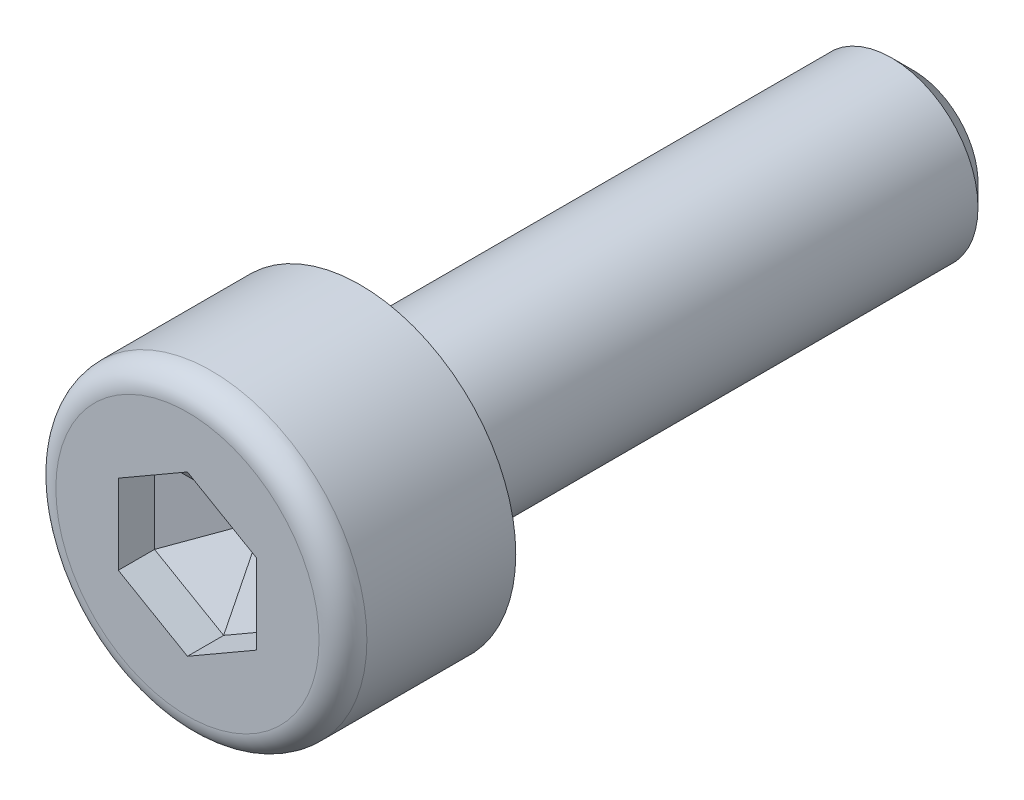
ISO-10303-21;
HEADER;
FILE_DESCRIPTION(('STEP AP214'),'2;1');
FILE_NAME('part.step','',(''),(''),'','','');
FILE_SCHEMA(('AUTOMOTIVE_DESIGN { 1 0 10303 214 1 1 1 1 }'));
ENDSEC;
DATA;
#1=APPLICATION_CONTEXT('core data for automotive mechanical design processes');
#2=APPLICATION_PROTOCOL_DEFINITION('international standard','automotive_design',2000,#1);
#3=PRODUCT_CONTEXT('',#1,'mechanical');
#4=PRODUCT('Part','Part','',(#3));
#5=PRODUCT_RELATED_PRODUCT_CATEGORY('part','',(#4));
#6=PRODUCT_DEFINITION_FORMATION('','',#4);
#7=PRODUCT_DEFINITION_CONTEXT('part definition',#1,'design');
#8=PRODUCT_DEFINITION('design','',#6,#7);
#9=PRODUCT_DEFINITION_SHAPE('','',#8);
#10=(LENGTH_UNIT() NAMED_UNIT(*) SI_UNIT(.MILLI.,.METRE.));
#11=(NAMED_UNIT(*) PLANE_ANGLE_UNIT() SI_UNIT($,.RADIAN.));
#12=(NAMED_UNIT(*) SI_UNIT($,.STERADIAN.) SOLID_ANGLE_UNIT());
#13=UNCERTAINTY_MEASURE_WITH_UNIT(LENGTH_MEASURE(1.E-05),#10,'distance_accuracy_value','');
#14=(GEOMETRIC_REPRESENTATION_CONTEXT(3) GLOBAL_UNCERTAINTY_ASSIGNED_CONTEXT((#13)) GLOBAL_UNIT_ASSIGNED_CONTEXT((#10,
#11,#12)) REPRESENTATION_CONTEXT('',''));
#15=CARTESIAN_POINT('',(0.,0.,0.));
#16=DIRECTION('',(0.,0.,1.));
#17=DIRECTION('',(1.,0.,0.));
#18=AXIS2_PLACEMENT_3D('',#15,#16,#17);
#19=CARTESIAN_POINT('',(0.,0.,0.));
#20=DIRECTION('',(0.,0.,1.));
#21=DIRECTION('',(1.,0.,0.));
#22=AXIS2_PLACEMENT_3D('',#19,#20,#21);
#23=PLANE('',#22);
#24=CARTESIAN_POINT('',(0.,0.,0.));
#25=DIRECTION('',(0.,0.,1.));
#26=DIRECTION('',(1.,0.,0.));
#27=AXIS2_PLACEMENT_3D('',#24,#25,#26);
#28=CIRCLE('',#27,1.35);
#29=CARTESIAN_POINT('',(1.35,0.,0.));
#30=VERTEX_POINT('',#29);
#31=EDGE_CURVE('E11',#30,#30,#28,.T.);
#32=ORIENTED_EDGE('',*,*,#31,.T.);
#33=EDGE_LOOP('',(#32));
#34=FACE_BOUND('',#33,.T.);
#35=CARTESIAN_POINT('',(0.,0.,0.));
#36=DIRECTION('',(0.,0.,1.));
#37=DIRECTION('',(1.,0.,0.));
#38=AXIS2_PLACEMENT_3D('',#35,#36,#37);
#39=CIRCLE('',#38,2.25);
#40=CARTESIAN_POINT('',(2.25,0.,0.));
#41=VERTEX_POINT('',#40);
#42=EDGE_CURVE('E171',#41,#41,#39,.T.);
#43=ORIENTED_EDGE('',*,*,#42,.F.);
#44=EDGE_LOOP('',(#43));
#45=FACE_BOUND('',#44,.T.);
#46=ADVANCED_FACE('F53',(#34,#45),#23,.F.);
#47=CARTESIAN_POINT('',(0.,0.,2.5));
#48=DIRECTION('',(0.,0.,-1.));
#49=DIRECTION('',(-1.,0.,0.));
#50=AXIS2_PLACEMENT_3D('',#47,#48,#49);
#51=CYLINDRICAL_SURFACE('',#50,2.25);
#52=CARTESIAN_POINT('',(0.,0.,2.15384615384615));
#53=DIRECTION('',(0.,0.,1.));
#54=DIRECTION('',(1.,0.,0.));
#55=AXIS2_PLACEMENT_3D('',#52,#53,#54);
#56=CIRCLE('',#55,2.25);
#57=CARTESIAN_POINT('',(2.25,0.,2.15384615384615));
#58=VERTEX_POINT('',#57);
#59=EDGE_CURVE('E197',#58,#58,#56,.F.);
#60=ORIENTED_EDGE('',*,*,#59,.T.);
#61=EDGE_LOOP('',(#60));
#62=FACE_BOUND('',#61,.T.);
#63=ORIENTED_EDGE('',*,*,#42,.T.);
#64=EDGE_LOOP('',(#63));
#65=FACE_BOUND('',#64,.T.);
#66=ADVANCED_FACE('F276',(#62,#65),#51,.T.);
#67=CARTESIAN_POINT('',(0.,0.,2.5));
#68=DIRECTION('',(0.,0.,1.));
#69=DIRECTION('',(1.,0.,0.));
#70=AXIS2_PLACEMENT_3D('',#67,#68,#69);
#71=PLANE('',#70);
#72=CARTESIAN_POINT('',(0.,0.,2.5));
#73=DIRECTION('',(0.,0.,1.));
#74=DIRECTION('',(1.,0.,0.));
#75=AXIS2_PLACEMENT_3D('',#72,#73,#74);
#76=CIRCLE('',#75,1.90384615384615);
#77=CARTESIAN_POINT('',(1.90384615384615,0.,2.5));
#78=VERTEX_POINT('',#77);
#79=EDGE_CURVE('E193',#78,#78,#76,.T.);
#80=ORIENTED_EDGE('',*,*,#79,.T.);
#81=EDGE_LOOP('',(#80));
#82=FACE_BOUND('',#81,.T.);
#83=DIRECTION('',(0.,1.,0.));
#84=VECTOR('',#83,1.);
#85=CARTESIAN_POINT('',(1.,-0.577350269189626,2.5));
#86=LINE('',#85,#84);
#87=CARTESIAN_POINT('',(1.,-0.577350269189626,2.5));
#88=VERTEX_POINT('',#87);
#89=CARTESIAN_POINT('',(1.,0.577350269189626,2.5));
#90=VERTEX_POINT('',#89);
#91=EDGE_CURVE('E148',#88,#90,#86,.T.);
#92=ORIENTED_EDGE('',*,*,#91,.F.);
#93=DIRECTION('',(0.866025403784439,0.5,0.));
#94=VECTOR('',#93,1.);
#95=CARTESIAN_POINT('',(0.,-1.15470053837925,2.5));
#96=LINE('',#95,#94);
#97=CARTESIAN_POINT('',(0.,-1.15470053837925,2.5));
#98=VERTEX_POINT('',#97);
#99=EDGE_CURVE('E164',#98,#88,#96,.T.);
#100=ORIENTED_EDGE('',*,*,#99,.F.);
#101=DIRECTION('',(0.866025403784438,-0.5,0.));
#102=VECTOR('',#101,1.);
#103=CARTESIAN_POINT('',(-1.,-0.577350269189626,2.5));
#104=LINE('',#103,#102);
#105=CARTESIAN_POINT('',(-1.,-0.577350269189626,2.5));
#106=VERTEX_POINT('',#105);
#107=EDGE_CURVE('E157',#106,#98,#104,.T.);
#108=ORIENTED_EDGE('',*,*,#107,.F.);
#109=DIRECTION('',(0.,-1.,0.));
#110=VECTOR('',#109,1.);
#111=CARTESIAN_POINT('',(-1.,0.577350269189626,2.5));
#112=LINE('',#111,#110);
#113=CARTESIAN_POINT('',(-1.,0.577350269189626,2.5));
#114=VERTEX_POINT('',#113);
#115=EDGE_CURVE('E153',#114,#106,#112,.T.);
#116=ORIENTED_EDGE('',*,*,#115,.F.);
#117=DIRECTION('',(-0.866025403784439,-0.5,0.));
#118=VECTOR('',#117,1.);
#119=CARTESIAN_POINT('',(0.,1.15470053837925,2.5));
#120=LINE('',#119,#118);
#121=CARTESIAN_POINT('',(0.,1.15470053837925,2.5));
#122=VERTEX_POINT('',#121);
#123=EDGE_CURVE('E131',#122,#114,#120,.T.);
#124=ORIENTED_EDGE('',*,*,#123,.F.);
#125=DIRECTION('',(-0.866025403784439,0.5,0.));
#126=VECTOR('',#125,1.);
#127=CARTESIAN_POINT('',(1.,0.577350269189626,2.5));
#128=LINE('',#127,#126);
#129=EDGE_CURVE('E142',#90,#122,#128,.T.);
#130=ORIENTED_EDGE('',*,*,#129,.F.);
#131=EDGE_LOOP('',(#92,#100,#108,#116,#124,#130));
#132=FACE_BOUND('',#131,.T.);
#133=ADVANCED_FACE('F150',(#82,#132),#71,.T.);
#134=CARTESIAN_POINT('',(1.,-0.577350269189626,1.4));
#135=DIRECTION('',(1.,0.,0.));
#136=DIRECTION('',(0.,0.,-1.));
#137=AXIS2_PLACEMENT_3D('',#134,#135,#136);
#138=PLANE('',#137);
#139=DIRECTION('',(0.,0.,1.));
#140=VECTOR('',#139,1.);
#141=CARTESIAN_POINT('',(1.,0.577350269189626,1.4));
#142=LINE('',#141,#140);
#143=CARTESIAN_POINT('',(1.,0.577350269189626,1.97636887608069));
#144=VERTEX_POINT('',#143);
#145=EDGE_CURVE('E139',#144,#90,#142,.T.);
#146=ORIENTED_EDGE('',*,*,#145,.F.);
#147=DIRECTION('',(0.,-1.,0.));
#148=VECTOR('',#147,1.);
#149=CARTESIAN_POINT('',(1.,-0.577350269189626,1.97636887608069));
#150=LINE('',#149,#148);
#151=CARTESIAN_POINT('',(1.,-0.577350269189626,1.97636887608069));
#152=VERTEX_POINT('',#151);
#153=EDGE_CURVE('E77',#144,#152,#150,.T.);
#154=ORIENTED_EDGE('',*,*,#153,.T.);
#155=DIRECTION('',(0.,0.,1.));
#156=VECTOR('',#155,1.);
#157=CARTESIAN_POINT('',(1.,-0.577350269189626,1.4));
#158=LINE('',#157,#156);
#159=EDGE_CURVE('E168',#152,#88,#158,.T.);
#160=ORIENTED_EDGE('',*,*,#159,.T.);
#161=ORIENTED_EDGE('',*,*,#91,.T.);
#162=EDGE_LOOP('',(#146,#154,#160,#161));
#163=FACE_BOUND('',#162,.T.);
#164=ADVANCED_FACE('F336',(#163),#138,.F.);
#165=CARTESIAN_POINT('',(0.,-1.15470053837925,1.4));
#166=DIRECTION('',(0.5,-0.866025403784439,0.));
#167=DIRECTION('',(0.866025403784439,0.5,0.));
#168=AXIS2_PLACEMENT_3D('',#165,#166,#167);
#169=PLANE('',#168);
#170=ORIENTED_EDGE('',*,*,#159,.F.);
#171=DIRECTION('',(-0.866025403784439,-0.5,0.));
#172=VECTOR('',#171,1.);
#173=CARTESIAN_POINT('',(0.,-1.15470053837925,1.97636887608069));
#174=LINE('',#173,#172);
#175=CARTESIAN_POINT('',(0.,-1.15470053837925,1.97636887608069));
#176=VERTEX_POINT('',#175);
#177=EDGE_CURVE('E69',#152,#176,#174,.T.);
#178=ORIENTED_EDGE('',*,*,#177,.T.);
#179=DIRECTION('',(0.,0.,1.));
#180=VECTOR('',#179,1.);
#181=CARTESIAN_POINT('',(0.,-1.15470053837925,1.4));
#182=LINE('',#181,#180);
#183=EDGE_CURVE('E172',#176,#98,#182,.T.);
#184=ORIENTED_EDGE('',*,*,#183,.T.);
#185=ORIENTED_EDGE('',*,*,#99,.T.);
#186=EDGE_LOOP('',(#170,#178,#184,#185));
#187=FACE_BOUND('',#186,.T.);
#188=ADVANCED_FACE('F339',(#187),#169,.F.);
#189=CARTESIAN_POINT('',(-1.,-0.577350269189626,1.4));
#190=DIRECTION('',(-0.5,-0.866025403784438,0.));
#191=DIRECTION('',(0.866025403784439,-0.5,0.));
#192=AXIS2_PLACEMENT_3D('',#189,#190,#191);
#193=PLANE('',#192);
#194=ORIENTED_EDGE('',*,*,#183,.F.);
#195=DIRECTION('',(-0.866025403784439,0.5,0.));
#196=VECTOR('',#195,1.);
#197=CARTESIAN_POINT('',(-1.,-0.577350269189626,1.97636887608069));
#198=LINE('',#197,#196);
#199=CARTESIAN_POINT('',(-1.,-0.577350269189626,1.97636887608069));
#200=VERTEX_POINT('',#199);
#201=EDGE_CURVE('E231',#176,#200,#198,.T.);
#202=ORIENTED_EDGE('',*,*,#201,.T.);
#203=DIRECTION('',(0.,0.,1.));
#204=VECTOR('',#203,1.);
#205=CARTESIAN_POINT('',(-1.,-0.577350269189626,1.4));
#206=LINE('',#205,#204);
#207=EDGE_CURVE('E175',#200,#106,#206,.T.);
#208=ORIENTED_EDGE('',*,*,#207,.T.);
#209=ORIENTED_EDGE('',*,*,#107,.T.);
#210=EDGE_LOOP('',(#194,#202,#208,#209));
#211=FACE_BOUND('',#210,.T.);
#212=ADVANCED_FACE('F327',(#211),#193,.F.);
#213=CARTESIAN_POINT('',(-1.,0.577350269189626,1.4));
#214=DIRECTION('',(-1.,0.,0.));
#215=DIRECTION('',(0.,0.,1.));
#216=AXIS2_PLACEMENT_3D('',#213,#214,#215);
#217=PLANE('',#216);
#218=ORIENTED_EDGE('',*,*,#207,.F.);
#219=DIRECTION('',(0.,1.,0.));
#220=VECTOR('',#219,1.);
#221=CARTESIAN_POINT('',(-1.,0.577350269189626,1.97636887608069));
#222=LINE('',#221,#220);
#223=CARTESIAN_POINT('',(-1.,0.577350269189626,1.97636887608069));
#224=VERTEX_POINT('',#223);
#225=EDGE_CURVE('E220',#200,#224,#222,.T.);
#226=ORIENTED_EDGE('',*,*,#225,.T.);
#227=DIRECTION('',(0.,0.,1.));
#228=VECTOR('',#227,1.);
#229=CARTESIAN_POINT('',(-1.,0.577350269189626,1.4));
#230=LINE('',#229,#228);
#231=EDGE_CURVE('E138',#224,#114,#230,.T.);
#232=ORIENTED_EDGE('',*,*,#231,.T.);
#233=ORIENTED_EDGE('',*,*,#115,.T.);
#234=EDGE_LOOP('',(#218,#226,#232,#233));
#235=FACE_BOUND('',#234,.T.);
#236=ADVANCED_FACE('F330',(#235),#217,.F.);
#237=CARTESIAN_POINT('',(0.,1.15470053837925,1.4));
#238=DIRECTION('',(-0.5,0.866025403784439,0.));
#239=DIRECTION('',(-0.866025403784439,-0.5,0.));
#240=AXIS2_PLACEMENT_3D('',#237,#238,#239);
#241=PLANE('',#240);
#242=ORIENTED_EDGE('',*,*,#231,.F.);
#243=DIRECTION('',(0.866025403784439,0.5,0.));
#244=VECTOR('',#243,1.);
#245=CARTESIAN_POINT('',(0.,1.15470053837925,1.97636887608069));
#246=LINE('',#245,#244);
#247=CARTESIAN_POINT('',(0.,1.15470053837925,1.97636887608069));
#248=VERTEX_POINT('',#247);
#249=EDGE_CURVE('E134',#224,#248,#246,.T.);
#250=ORIENTED_EDGE('',*,*,#249,.T.);
#251=DIRECTION('',(0.,0.,1.));
#252=VECTOR('',#251,1.);
#253=CARTESIAN_POINT('',(0.,1.15470053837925,1.4));
#254=LINE('',#253,#252);
#255=EDGE_CURVE('E126',#248,#122,#254,.T.);
#256=ORIENTED_EDGE('',*,*,#255,.T.);
#257=ORIENTED_EDGE('',*,*,#123,.T.);
#258=EDGE_LOOP('',(#242,#250,#256,#257));
#259=FACE_BOUND('',#258,.T.);
#260=ADVANCED_FACE('F129',(#259),#241,.F.);
#261=CARTESIAN_POINT('',(1.,0.577350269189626,1.4));
#262=DIRECTION('',(0.5,0.866025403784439,0.));
#263=DIRECTION('',(-0.866025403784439,0.5,0.));
#264=AXIS2_PLACEMENT_3D('',#261,#262,#263);
#265=PLANE('',#264);
#266=ORIENTED_EDGE('',*,*,#255,.F.);
#267=DIRECTION('',(0.866025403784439,-0.5,0.));
#268=VECTOR('',#267,1.);
#269=CARTESIAN_POINT('',(1.,0.577350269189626,1.97636887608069));
#270=LINE('',#269,#268);
#271=EDGE_CURVE('E226',#248,#144,#270,.T.);
#272=ORIENTED_EDGE('',*,*,#271,.T.);
#273=ORIENTED_EDGE('',*,*,#145,.T.);
#274=ORIENTED_EDGE('',*,*,#129,.T.);
#275=EDGE_LOOP('',(#266,#272,#273,#274));
#276=FACE_BOUND('',#275,.T.);
#277=ADVANCED_FACE('F143',(#276),#265,.F.);
#278=CARTESIAN_POINT('',(0.,0.,1.4));
#279=DIRECTION('',(0.,0.,1.));
#280=DIRECTION('',(1.,0.,0.));
#281=AXIS2_PLACEMENT_3D('',#278,#279,#280);
#282=PLANE('',#281);
#283=DIRECTION('',(-0.866025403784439,-0.5,0.));
#284=VECTOR('',#283,1.);
#285=CARTESIAN_POINT('',(-0.000849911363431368,0.00147208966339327,1.4));
#286=LINE('',#285,#284);
#287=CARTESIAN_POINT('',(0.,0.00196278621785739,1.4));
#288=VERTEX_POINT('',#287);
#289=CARTESIAN_POINT('',(-0.0016998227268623,0.000981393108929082,1.4));
#290=VERTEX_POINT('',#289);
#291=EDGE_CURVE('E213',#288,#290,#286,.T.);
#292=ORIENTED_EDGE('',*,*,#291,.T.);
#293=DIRECTION('',(0.,-1.,0.));
#294=VECTOR('',#293,1.);
#295=CARTESIAN_POINT('',(-0.0016998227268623,0.,1.4));
#296=LINE('',#295,#294);
#297=CARTESIAN_POINT('',(-0.0016998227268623,-0.000981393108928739,1.4));
#298=VERTEX_POINT('',#297);
#299=EDGE_CURVE('E216',#290,#298,#296,.T.);
#300=ORIENTED_EDGE('',*,*,#299,.T.);
#301=DIRECTION('',(0.866025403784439,-0.5,0.));
#302=VECTOR('',#301,1.);
#303=CARTESIAN_POINT('',(-0.000849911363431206,-0.00147208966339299,1.4));
#304=LINE('',#303,#302);
#305=CARTESIAN_POINT('',(0.,-0.00196278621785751,1.4));
#306=VERTEX_POINT('',#305);
#307=EDGE_CURVE('E204',#298,#306,#304,.T.);
#308=ORIENTED_EDGE('',*,*,#307,.T.);
#309=DIRECTION('',(0.866025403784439,0.5,0.));
#310=VECTOR('',#309,1.);
#311=CARTESIAN_POINT('',(0.000849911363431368,-0.00147208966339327,1.4));
#312=LINE('',#311,#310);
#313=CARTESIAN_POINT('',(0.0016998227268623,-0.000981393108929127,1.4));
#314=VERTEX_POINT('',#313);
#315=EDGE_CURVE('E201',#306,#314,#312,.T.);
#316=ORIENTED_EDGE('',*,*,#315,.T.);
#317=DIRECTION('',(0.,1.,0.));
#318=VECTOR('',#317,1.);
#319=CARTESIAN_POINT('',(0.0016998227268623,0.,1.4));
#320=LINE('',#319,#318);
#321=CARTESIAN_POINT('',(0.0016998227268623,0.000981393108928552,1.4));
#322=VERTEX_POINT('',#321);
#323=EDGE_CURVE('E207',#314,#322,#320,.T.);
#324=ORIENTED_EDGE('',*,*,#323,.T.);
#325=DIRECTION('',(-0.866025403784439,0.5,0.));
#326=VECTOR('',#325,1.);
#327=CARTESIAN_POINT('',(0.000849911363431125,0.00147208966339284,1.4));
#328=LINE('',#327,#326);
#329=EDGE_CURVE('E210',#322,#288,#328,.T.);
#330=ORIENTED_EDGE('',*,*,#329,.T.);
#331=EDGE_LOOP('',(#292,#300,#308,#316,#324,#330));
#332=FACE_BOUND('',#331,.T.);
#333=ADVANCED_FACE('F348',(#332),#282,.T.);
#334=CARTESIAN_POINT('',(0.,0.,-8.));
#335=DIRECTION('',(0.,0.,1.));
#336=DIRECTION('',(1.,0.,0.));
#337=AXIS2_PLACEMENT_3D('',#334,#335,#336);
#338=CYLINDRICAL_SURFACE('',#337,1.25);
#339=CARTESIAN_POINT('',(0.,0.,-0.0999999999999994));
#340=DIRECTION('',(0.,0.,1.));
#341=DIRECTION('',(1.,0.,0.));
#342=AXIS2_PLACEMENT_3D('',#339,#340,#341);
#343=CIRCLE('',#342,1.25);
#344=CARTESIAN_POINT('',(1.25,0.,-0.0999999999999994));
#345=VERTEX_POINT('',#344);
#346=EDGE_CURVE('E62',#345,#345,#343,.F.);
#347=ORIENTED_EDGE('',*,*,#346,.T.);
#348=EDGE_LOOP('',(#347));
#349=FACE_BOUND('',#348,.T.);
#350=CARTESIAN_POINT('',(0.,0.,-7.6875));
#351=DIRECTION('',(0.,0.,-1.));
#352=DIRECTION('',(-1.,0.,0.));
#353=AXIS2_PLACEMENT_3D('',#350,#351,#352);
#354=CIRCLE('',#353,1.25);
#355=CARTESIAN_POINT('',(-1.25,0.,-7.6875));
#356=VERTEX_POINT('',#355);
#357=EDGE_CURVE('E189',#356,#356,#354,.F.);
#358=ORIENTED_EDGE('',*,*,#357,.T.);
#359=EDGE_LOOP('',(#358));
#360=FACE_BOUND('',#359,.T.);
#361=ADVANCED_FACE('F261',(#349,#360),#338,.T.);
#362=CARTESIAN_POINT('',(0.,0.,-8.));
#363=DIRECTION('',(0.,0.,-1.));
#364=DIRECTION('',(-1.,0.,0.));
#365=AXIS2_PLACEMENT_3D('',#362,#363,#364);
#366=PLANE('',#365);
#367=CARTESIAN_POINT('',(0.,0.,-8.));
#368=DIRECTION('',(0.,0.,-1.));
#369=DIRECTION('',(-1.,0.,0.));
#370=AXIS2_PLACEMENT_3D('',#367,#368,#369);
#371=CIRCLE('',#370,0.937500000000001);
#372=CARTESIAN_POINT('',(-0.937500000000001,0.,-8.));
#373=VERTEX_POINT('',#372);
#374=EDGE_CURVE('E185',#373,#373,#371,.T.);
#375=ORIENTED_EDGE('',*,*,#374,.T.);
#376=EDGE_LOOP('',(#375));
#377=FACE_BOUND('',#376,.T.);
#378=ADVANCED_FACE('F292',(#377),#366,.T.);
#379=CARTESIAN_POINT('',(0.,0.,-8.));
#380=DIRECTION('',(0.,0.,1.));
#381=DIRECTION('',(1.,0.,0.));
#382=AXIS2_PLACEMENT_3D('',#379,#380,#381);
#383=CONICAL_SURFACE('',#382,0.937500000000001,0.785398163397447);
#384=ORIENTED_EDGE('',*,*,#357,.F.);
#385=EDGE_LOOP('',(#384));
#386=FACE_BOUND('',#385,.T.);
#387=ORIENTED_EDGE('',*,*,#374,.F.);
#388=EDGE_LOOP('',(#387));
#389=FACE_BOUND('',#388,.T.);
#390=ADVANCED_FACE('F288',(#386,#389),#383,.T.);
#391=CARTESIAN_POINT('',(0.,0.,2.15384615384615));
#392=DIRECTION('',(0.,0.,1.));
#393=DIRECTION('',(1.,0.,0.));
#394=AXIS2_PLACEMENT_3D('',#391,#392,#393);
#395=TOROIDAL_SURFACE('',#394,1.90384615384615,0.346153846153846);
#396=ORIENTED_EDGE('',*,*,#59,.F.);
#397=EDGE_LOOP('',(#396));
#398=FACE_BOUND('',#397,.T.);
#399=ORIENTED_EDGE('',*,*,#79,.F.);
#400=EDGE_LOOP('',(#399));
#401=FACE_BOUND('',#400,.T.);
#402=ADVANCED_FACE('F291',(#398,#401),#395,.T.);
#403=CARTESIAN_POINT('',(0.0016998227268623,0.,1.4));
#404=DIRECTION('',(0.499999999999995,0.,-0.866025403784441));
#405=DIRECTION('',(0.,1.,0.));
#406=AXIS2_PLACEMENT_3D('',#403,#404,#405);
#407=PLANE('',#406);
#408=DIRECTION('',(-0.774596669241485,0.447213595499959,-0.447213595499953));
#409=VECTOR('',#408,1.);
#410=CARTESIAN_POINT('',(0.00135985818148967,-0.000785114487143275,1.39980372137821));
#411=LINE('',#410,#409);
#412=EDGE_CURVE('E250',#152,#314,#411,.T.);
#413=ORIENTED_EDGE('',*,*,#412,.F.);
#414=ORIENTED_EDGE('',*,*,#153,.F.);
#415=DIRECTION('',(-0.774596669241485,-0.447213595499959,-0.447213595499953));
#416=VECTOR('',#415,1.);
#417=CARTESIAN_POINT('',(0.00135985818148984,0.000785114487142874,1.39980372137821));
#418=LINE('',#417,#416);
#419=EDGE_CURVE('E254',#322,#144,#418,.F.);
#420=ORIENTED_EDGE('',*,*,#419,.F.);
#421=ORIENTED_EDGE('',*,*,#323,.F.);
#422=EDGE_LOOP('',(#413,#414,#420,#421));
#423=FACE_BOUND('',#422,.T.);
#424=ADVANCED_FACE('F295',(#423),#407,.F.);
#425=CARTESIAN_POINT('',(0.000849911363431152,0.00147208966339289,1.4));
#426=DIRECTION('',(0.249999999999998,0.433012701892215,-0.866025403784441));
#427=DIRECTION('',(-0.866025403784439,0.5,0.));
#428=AXIS2_PLACEMENT_3D('',#425,#426,#427);
#429=PLANE('',#428);
#430=ORIENTED_EDGE('',*,*,#419,.T.);
#431=ORIENTED_EDGE('',*,*,#271,.F.);
#432=DIRECTION('',(0.,-0.894427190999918,-0.447213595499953));
#433=VECTOR('',#432,1.);
#434=CARTESIAN_POINT('',(0.,0.00157022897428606,1.39980372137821));
#435=LINE('',#434,#433);
#436=EDGE_CURVE('E246',#288,#248,#435,.F.);
#437=ORIENTED_EDGE('',*,*,#436,.F.);
#438=ORIENTED_EDGE('',*,*,#329,.F.);
#439=EDGE_LOOP('',(#430,#431,#437,#438));
#440=FACE_BOUND('',#439,.T.);
#441=ADVANCED_FACE('F308',(#440),#429,.F.);
#442=CARTESIAN_POINT('',(0.000849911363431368,-0.00147208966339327,1.4));
#443=DIRECTION('',(0.249999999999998,-0.433012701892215,-0.866025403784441));
#444=DIRECTION('',(0.866025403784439,0.5,0.));
#445=AXIS2_PLACEMENT_3D('',#442,#443,#444);
#446=PLANE('',#445);
#447=ORIENTED_EDGE('',*,*,#412,.T.);
#448=ORIENTED_EDGE('',*,*,#315,.F.);
#449=DIRECTION('',(0.,-0.894427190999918,0.447213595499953));
#450=VECTOR('',#449,1.);
#451=CARTESIAN_POINT('',(0.,-0.00157022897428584,1.39980372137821));
#452=LINE('',#451,#450);
#453=EDGE_CURVE('E242',#176,#306,#452,.F.);
#454=ORIENTED_EDGE('',*,*,#453,.F.);
#455=ORIENTED_EDGE('',*,*,#177,.F.);
#456=EDGE_LOOP('',(#447,#448,#454,#455));
#457=FACE_BOUND('',#456,.T.);
#458=ADVANCED_FACE('F304',(#457),#446,.F.);
#459=CARTESIAN_POINT('',(-0.000849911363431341,0.00147208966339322,1.4));
#460=DIRECTION('',(-0.249999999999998,0.433012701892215,-0.866025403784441));
#461=DIRECTION('',(-0.866025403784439,-0.5,0.));
#462=AXIS2_PLACEMENT_3D('',#459,#460,#461);
#463=PLANE('',#462);
#464=ORIENTED_EDGE('',*,*,#436,.T.);
#465=ORIENTED_EDGE('',*,*,#249,.F.);
#466=DIRECTION('',(0.774596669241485,-0.447213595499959,-0.447213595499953));
#467=VECTOR('',#466,1.);
#468=CARTESIAN_POINT('',(-0.00135985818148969,0.000785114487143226,1.39980372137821));
#469=LINE('',#468,#467);
#470=EDGE_CURVE('E239',#290,#224,#469,.F.);
#471=ORIENTED_EDGE('',*,*,#470,.F.);
#472=ORIENTED_EDGE('',*,*,#291,.F.);
#473=EDGE_LOOP('',(#464,#465,#471,#472));
#474=FACE_BOUND('',#473,.T.);
#475=ADVANCED_FACE('F300',(#474),#463,.F.);
#476=CARTESIAN_POINT('',(-0.000849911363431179,-0.00147208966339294,1.4));
#477=DIRECTION('',(-0.249999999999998,-0.433012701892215,-0.866025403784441));
#478=DIRECTION('',(0.866025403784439,-0.5,0.));
#479=AXIS2_PLACEMENT_3D('',#476,#477,#478);
#480=PLANE('',#479);
#481=ORIENTED_EDGE('',*,*,#453,.T.);
#482=ORIENTED_EDGE('',*,*,#307,.F.);
#483=DIRECTION('',(-0.774596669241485,-0.447213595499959,0.447213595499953));
#484=VECTOR('',#483,1.);
#485=CARTESIAN_POINT('',(-0.00135985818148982,-0.000785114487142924,1.39980372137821));
#486=LINE('',#485,#484);
#487=EDGE_CURVE('E236',#200,#298,#486,.F.);
#488=ORIENTED_EDGE('',*,*,#487,.F.);
#489=ORIENTED_EDGE('',*,*,#201,.F.);
#490=EDGE_LOOP('',(#481,#482,#488,#489));
#491=FACE_BOUND('',#490,.T.);
#492=ADVANCED_FACE('F271',(#491),#480,.F.);
#493=CARTESIAN_POINT('',(-0.0016998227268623,0.,1.4));
#494=DIRECTION('',(-0.499999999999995,0.,-0.866025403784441));
#495=DIRECTION('',(0.,-1.,0.));
#496=AXIS2_PLACEMENT_3D('',#493,#494,#495);
#497=PLANE('',#496);
#498=ORIENTED_EDGE('',*,*,#470,.T.);
#499=ORIENTED_EDGE('',*,*,#225,.F.);
#500=ORIENTED_EDGE('',*,*,#487,.T.);
#501=ORIENTED_EDGE('',*,*,#299,.F.);
#502=EDGE_LOOP('',(#498,#499,#500,#501));
#503=FACE_BOUND('',#502,.T.);
#504=ADVANCED_FACE('F265',(#503),#497,.F.);
#505=CARTESIAN_POINT('',(0.,0.,-0.0999999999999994));
#506=DIRECTION('',(0.,0.,1.));
#507=DIRECTION('',(1.,0.,0.));
#508=AXIS2_PLACEMENT_3D('',#505,#506,#507);
#509=TOROIDAL_SURFACE('',#508,1.35,0.1);
#510=ORIENTED_EDGE('',*,*,#31,.F.);
#511=EDGE_LOOP('',(#510));
#512=FACE_BOUND('',#511,.T.);
#513=ORIENTED_EDGE('',*,*,#346,.F.);
#514=EDGE_LOOP('',(#513));
#515=FACE_BOUND('',#514,.T.);
#516=ADVANCED_FACE('F55',(#512,#515),#509,.F.);
#517=CLOSED_SHELL('',(#46,#66,#133,#164,#188,#212,#236,#260,#277,#333,#361,#378,#390,#402,#424,
#441,#458,#475,#492,#504,#516));
#518=MANIFOLD_SOLID_BREP('B2',#517);
#519=ADVANCED_BREP_SHAPE_REPRESENTATION('',(#18,#518),#14);
#520=SHAPE_DEFINITION_REPRESENTATION(#9,#519);
ENDSEC;
END-ISO-10303-21;
